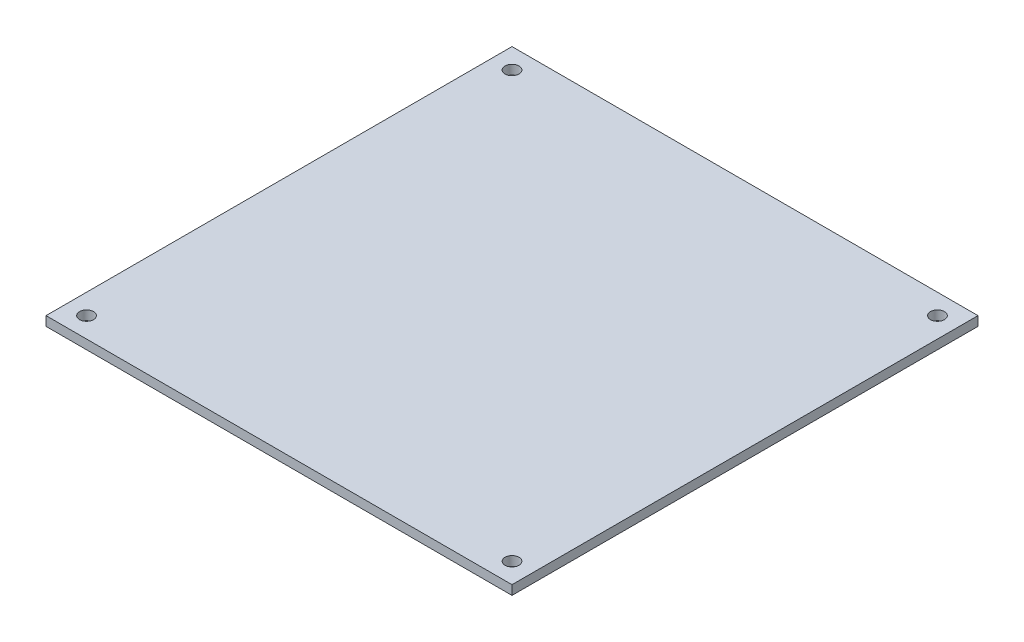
from build123d import *

# Parameters (mm, degrees)
ESQUISSE1_W        = 100
ESQUISSE1_H        = 100
ESQUISSE1_R        = 1.5
BOSS_EXTRU_1_DEPTH = 2


with BuildPart() as part:
    # Esquisse1 → Boss.-Extru.1 (new body)
    with BuildSketch(Plane(origin=(0, 0, 0), x_dir=(1, 0, 0), z_dir=(0, 1, 0))):
        with Locations((-0.50211583, -1.129760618)):
            Rectangle(ESQUISSE1_W, ESQUISSE1_H)
        with Locations(Location((45.14788417, -46.779760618, 0), (0, 0, 270))):
            Circle(ESQUISSE1_R, mode=Mode.SUBTRACT)
        with Locations(Location((-46.15211583, -46.779760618, 0), (0, 0, 270))):
            Circle(ESQUISSE1_R, mode=Mode.SUBTRACT)
        with Locations(Location((-46.15211583, 44.520239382, 0), (0, 0, 270))):
            Circle(ESQUISSE1_R, mode=Mode.SUBTRACT)
        with Locations(Location((45.14788417, 44.520239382, 0), (0, 0, 270))):
            Circle(ESQUISSE1_R, mode=Mode.SUBTRACT)
    extrude(amount=BOSS_EXTRU_1_DEPTH)


solid = part.part
